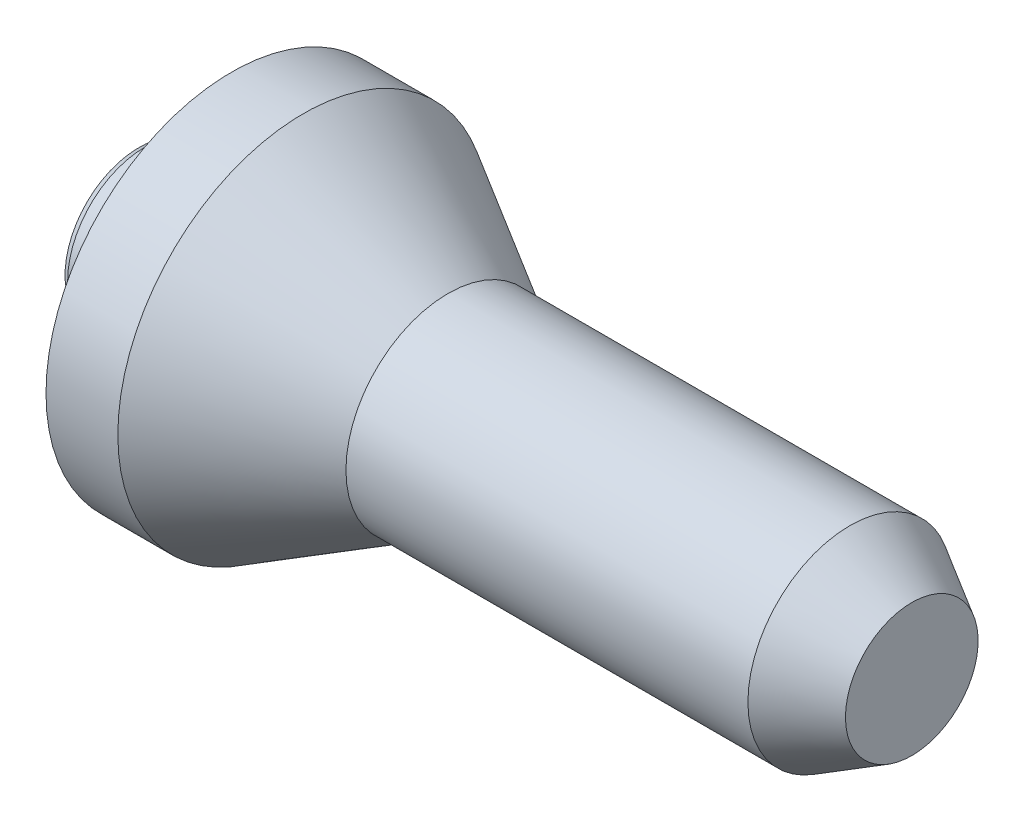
ISO-10303-21;
HEADER;
FILE_DESCRIPTION(('STEP AP214'),'2;1');
FILE_NAME('part.step','',(''),(''),'','','');
FILE_SCHEMA(('AUTOMOTIVE_DESIGN { 1 0 10303 214 1 1 1 1 }'));
ENDSEC;
DATA;
#1=APPLICATION_CONTEXT('core data for automotive mechanical design processes');
#2=APPLICATION_PROTOCOL_DEFINITION('international standard','automotive_design',2000,#1);
#3=PRODUCT_CONTEXT('',#1,'mechanical');
#4=PRODUCT('Part','Part','',(#3));
#5=PRODUCT_RELATED_PRODUCT_CATEGORY('part','',(#4));
#6=PRODUCT_DEFINITION_FORMATION('','',#4);
#7=PRODUCT_DEFINITION_CONTEXT('part definition',#1,'design');
#8=PRODUCT_DEFINITION('design','',#6,#7);
#9=PRODUCT_DEFINITION_SHAPE('','',#8);
#10=(LENGTH_UNIT() NAMED_UNIT(*) SI_UNIT(.MILLI.,.METRE.));
#11=(NAMED_UNIT(*) PLANE_ANGLE_UNIT() SI_UNIT($,.RADIAN.));
#12=(NAMED_UNIT(*) SI_UNIT($,.STERADIAN.) SOLID_ANGLE_UNIT());
#13=UNCERTAINTY_MEASURE_WITH_UNIT(LENGTH_MEASURE(1.E-05),#10,'distance_accuracy_value','');
#14=(GEOMETRIC_REPRESENTATION_CONTEXT(3) GLOBAL_UNCERTAINTY_ASSIGNED_CONTEXT((#13)) GLOBAL_UNIT_ASSIGNED_CONTEXT((#10,
#11,#12)) REPRESENTATION_CONTEXT('',''));
#15=CARTESIAN_POINT('',(0.,0.,0.));
#16=DIRECTION('',(0.,0.,1.));
#17=DIRECTION('',(1.,0.,0.));
#18=AXIS2_PLACEMENT_3D('',#15,#16,#17);
#19=CARTESIAN_POINT('',(0.,0.,0.));
#20=DIRECTION('',(1.,0.,0.));
#21=DIRECTION('',(0.,0.,-1.));
#22=AXIS2_PLACEMENT_3D('',#19,#20,#21);
#23=PLANE('',#22);
#24=CARTESIAN_POINT('',(0.,0.,0.));
#25=DIRECTION('',(1.,0.,0.));
#26=DIRECTION('',(0.,0.,-1.));
#27=AXIS2_PLACEMENT_3D('',#24,#25,#26);
#28=CIRCLE('',#27,11.9226497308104);
#29=CARTESIAN_POINT('',(0.,0.,-11.9226497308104));
#30=VERTEX_POINT('',#29);
#31=EDGE_CURVE('E40',#30,#30,#28,.F.);
#32=ORIENTED_EDGE('',*,*,#31,.T.);
#33=EDGE_LOOP('',(#32));
#34=FACE_BOUND('',#33,.T.);
#35=CARTESIAN_POINT('',(0.,0.,0.));
#36=DIRECTION('',(-1.,0.,0.));
#37=DIRECTION('',(0.,0.,1.));
#38=AXIS2_PLACEMENT_3D('',#35,#36,#37);
#39=CIRCLE('',#38,8.25);
#40=CARTESIAN_POINT('',(0.,0.,8.25));
#41=VERTEX_POINT('',#40);
#42=EDGE_CURVE('E60',#41,#41,#39,.T.);
#43=ORIENTED_EDGE('',*,*,#42,.F.);
#44=EDGE_LOOP('',(#43));
#45=FACE_BOUND('',#44,.T.);
#46=ADVANCED_FACE('F33',(#34,#45),#23,.F.);
#47=CARTESIAN_POINT('',(-16.4655274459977,0.,0.));
#48=DIRECTION('',(-1.,0.,0.));
#49=DIRECTION('',(0.,0.,1.));
#50=AXIS2_PLACEMENT_3D('',#47,#48,#49);
#51=CYLINDRICAL_SURFACE('',#50,12.5);
#52=CARTESIAN_POINT('',(1.00000000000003,0.,0.));
#53=DIRECTION('',(1.,0.,0.));
#54=DIRECTION('',(0.,0.,-1.));
#55=AXIS2_PLACEMENT_3D('',#52,#53,#54);
#56=CIRCLE('',#55,12.5);
#57=CARTESIAN_POINT('',(1.00000000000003,0.,-12.5));
#58=VERTEX_POINT('',#57);
#59=EDGE_CURVE('E11',#58,#58,#56,.T.);
#60=ORIENTED_EDGE('',*,*,#59,.T.);
#61=EDGE_LOOP('',(#60));
#62=FACE_BOUND('',#61,.T.);
#63=CARTESIAN_POINT('',(15.,0.,0.));
#64=DIRECTION('',(-1.,0.,0.));
#65=DIRECTION('',(0.,0.,1.));
#66=AXIS2_PLACEMENT_3D('',#63,#64,#65);
#67=CIRCLE('',#66,12.5);
#68=CARTESIAN_POINT('',(15.,0.,12.5));
#69=VERTEX_POINT('',#68);
#70=EDGE_CURVE('E75',#69,#69,#67,.T.);
#71=ORIENTED_EDGE('',*,*,#70,.T.);
#72=EDGE_LOOP('',(#71));
#73=FACE_BOUND('',#72,.T.);
#74=ADVANCED_FACE('F92',(#62,#73),#51,.T.);
#75=CARTESIAN_POINT('',(15.,12.5,0.));
#76=DIRECTION('',(1.,0.,0.));
#77=DIRECTION('',(0.,0.,-1.));
#78=AXIS2_PLACEMENT_3D('',#75,#76,#77);
#79=PLANE('',#78);
#80=ORIENTED_EDGE('',*,*,#70,.F.);
#81=EDGE_LOOP('',(#80));
#82=FACE_BOUND('',#81,.T.);
#83=CARTESIAN_POINT('',(15.,0.,0.));
#84=DIRECTION('',(-1.,0.,0.));
#85=DIRECTION('',(0.,0.,1.));
#86=AXIS2_PLACEMENT_3D('',#83,#84,#85);
#87=CIRCLE('',#86,30.);
#88=CARTESIAN_POINT('',(15.,0.,30.));
#89=VERTEX_POINT('',#88);
#90=EDGE_CURVE('E72',#89,#89,#87,.T.);
#91=ORIENTED_EDGE('',*,*,#90,.T.);
#92=EDGE_LOOP('',(#91));
#93=FACE_BOUND('',#92,.T.);
#94=ADVANCED_FACE('F96',(#82,#93),#79,.F.);
#95=CARTESIAN_POINT('',(-16.4655274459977,0.,0.));
#96=DIRECTION('',(-1.,0.,0.));
#97=DIRECTION('',(0.,0.,1.));
#98=AXIS2_PLACEMENT_3D('',#95,#96,#97);
#99=CYLINDRICAL_SURFACE('',#98,30.);
#100=ORIENTED_EDGE('',*,*,#90,.F.);
#101=EDGE_LOOP('',(#100));
#102=FACE_BOUND('',#101,.T.);
#103=CARTESIAN_POINT('',(26.6173140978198,0.,0.));
#104=DIRECTION('',(-1.,0.,0.));
#105=DIRECTION('',(0.,0.,1.));
#106=AXIS2_PLACEMENT_3D('',#103,#104,#105);
#107=CIRCLE('',#106,30.);
#108=CARTESIAN_POINT('',(26.6173140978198,0.,30.));
#109=VERTEX_POINT('',#108);
#110=EDGE_CURVE('E69',#109,#109,#107,.T.);
#111=ORIENTED_EDGE('',*,*,#110,.T.);
#112=EDGE_LOOP('',(#111));
#113=FACE_BOUND('',#112,.T.);
#114=ADVANCED_FACE('F102',(#102,#113),#99,.T.);
#115=CARTESIAN_POINT('',(50.,0.,0.));
#116=DIRECTION('',(-1.,0.,0.));
#117=DIRECTION('',(0.,0.,1.));
#118=AXIS2_PLACEMENT_3D('',#115,#116,#117);
#119=CONICAL_SURFACE('',#118,16.5,0.523598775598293);
#120=ORIENTED_EDGE('',*,*,#110,.F.);
#121=EDGE_LOOP('',(#120));
#122=FACE_BOUND('',#121,.T.);
#123=CARTESIAN_POINT('',(50.,0.,0.));
#124=DIRECTION('',(-1.,0.,0.));
#125=DIRECTION('',(0.,0.,1.));
#126=AXIS2_PLACEMENT_3D('',#123,#124,#125);
#127=CIRCLE('',#126,16.5);
#128=CARTESIAN_POINT('',(50.,0.,16.5));
#129=VERTEX_POINT('',#128);
#130=EDGE_CURVE('E66',#129,#129,#127,.T.);
#131=ORIENTED_EDGE('',*,*,#130,.T.);
#132=EDGE_LOOP('',(#131));
#133=FACE_BOUND('',#132,.T.);
#134=ADVANCED_FACE('F106',(#122,#133),#119,.T.);
#135=CARTESIAN_POINT('',(-16.4655274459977,0.,0.));
#136=DIRECTION('',(-1.,0.,0.));
#137=DIRECTION('',(0.,0.,1.));
#138=AXIS2_PLACEMENT_3D('',#135,#136,#137);
#139=CYLINDRICAL_SURFACE('',#138,16.5);
#140=ORIENTED_EDGE('',*,*,#130,.F.);
#141=EDGE_LOOP('',(#140));
#142=FACE_BOUND('',#141,.T.);
#143=CARTESIAN_POINT('',(115.,0.,0.));
#144=DIRECTION('',(-1.,0.,0.));
#145=DIRECTION('',(0.,0.,1.));
#146=AXIS2_PLACEMENT_3D('',#143,#144,#145);
#147=CIRCLE('',#146,16.5);
#148=CARTESIAN_POINT('',(115.,0.,16.5));
#149=VERTEX_POINT('',#148);
#150=EDGE_CURVE('E57',#149,#149,#147,.T.);
#151=ORIENTED_EDGE('',*,*,#150,.T.);
#152=EDGE_LOOP('',(#151));
#153=FACE_BOUND('',#152,.T.);
#154=ADVANCED_FACE('F110',(#142,#153),#139,.T.);
#155=CARTESIAN_POINT('',(125.,0.,0.));
#156=DIRECTION('',(-1.,0.,0.));
#157=DIRECTION('',(0.,0.,1.));
#158=AXIS2_PLACEMENT_3D('',#155,#156,#157);
#159=CONICAL_SURFACE('',#158,10.7264973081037,0.5235987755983);
#160=ORIENTED_EDGE('',*,*,#150,.F.);
#161=EDGE_LOOP('',(#160));
#162=FACE_BOUND('',#161,.T.);
#163=CARTESIAN_POINT('',(125.,0.,0.));
#164=DIRECTION('',(-1.,0.,0.));
#165=DIRECTION('',(0.,0.,1.));
#166=AXIS2_PLACEMENT_3D('',#163,#164,#165);
#167=CIRCLE('',#166,10.7264973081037);
#168=CARTESIAN_POINT('',(125.,0.,10.7264973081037));
#169=VERTEX_POINT('',#168);
#170=EDGE_CURVE('E53',#169,#169,#167,.T.);
#171=ORIENTED_EDGE('',*,*,#170,.T.);
#172=EDGE_LOOP('',(#171));
#173=FACE_BOUND('',#172,.T.);
#174=ADVANCED_FACE('F114',(#162,#173),#159,.T.);
#175=CARTESIAN_POINT('',(125.,10.7264973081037,0.));
#176=DIRECTION('',(-1.,0.,0.));
#177=DIRECTION('',(0.,0.,1.));
#178=AXIS2_PLACEMENT_3D('',#175,#176,#177);
#179=PLANE('',#178);
#180=ORIENTED_EDGE('',*,*,#170,.F.);
#181=EDGE_LOOP('',(#180));
#182=FACE_BOUND('',#181,.T.);
#183=ADVANCED_FACE('F47',(#182),#179,.F.);
#184=CARTESIAN_POINT('',(45.,0.,0.));
#185=DIRECTION('',(-1.,0.,0.));
#186=DIRECTION('',(0.,0.,1.));
#187=AXIS2_PLACEMENT_3D('',#184,#185,#186);
#188=CONICAL_SURFACE('',#187,6.99999999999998,1.02974425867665);
#189=CARTESIAN_POINT('',(49.2060243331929,0.,0.));
#190=VERTEX_POINT('',#189);
#191=VERTEX_LOOP('',#190);
#192=FACE_BOUND('',#191,.T.);
#193=CARTESIAN_POINT('',(45.,0.,0.));
#194=DIRECTION('',(-1.,0.,0.));
#195=DIRECTION('',(0.,0.,1.));
#196=AXIS2_PLACEMENT_3D('',#193,#194,#195);
#197=CIRCLE('',#196,6.99999999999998);
#198=CARTESIAN_POINT('',(45.,0.,6.99999999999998));
#199=VERTEX_POINT('',#198);
#200=EDGE_CURVE('E51',#199,#199,#197,.T.);
#201=ORIENTED_EDGE('',*,*,#200,.T.);
#202=EDGE_LOOP('',(#201));
#203=FACE_BOUND('',#202,.T.);
#204=ADVANCED_FACE('F43',(#192,#203),#188,.F.);
#205=CARTESIAN_POINT('',(0.,0.,0.));
#206=DIRECTION('',(-1.,0.,0.));
#207=DIRECTION('',(0.,0.,1.));
#208=AXIS2_PLACEMENT_3D('',#205,#206,#207);
#209=CYLINDRICAL_SURFACE('',#208,6.99999999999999);
#210=ORIENTED_EDGE('',*,*,#200,.F.);
#211=EDGE_LOOP('',(#210));
#212=FACE_BOUND('',#211,.T.);
#213=CARTESIAN_POINT('',(1.25,0.,0.));
#214=DIRECTION('',(-1.,0.,0.));
#215=DIRECTION('',(0.,0.,1.));
#216=AXIS2_PLACEMENT_3D('',#213,#214,#215);
#217=CIRCLE('',#216,6.99999999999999);
#218=CARTESIAN_POINT('',(1.25,0.,6.99999999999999));
#219=VERTEX_POINT('',#218);
#220=EDGE_CURVE('E54',#219,#219,#217,.T.);
#221=ORIENTED_EDGE('',*,*,#220,.T.);
#222=EDGE_LOOP('',(#221));
#223=FACE_BOUND('',#222,.T.);
#224=ADVANCED_FACE('F46',(#212,#223),#209,.F.);
#225=CARTESIAN_POINT('',(0.,0.,0.));
#226=DIRECTION('',(-1.,0.,0.));
#227=DIRECTION('',(0.,0.,1.));
#228=AXIS2_PLACEMENT_3D('',#225,#226,#227);
#229=CONICAL_SURFACE('',#228,8.25,0.78539816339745);
#230=ORIENTED_EDGE('',*,*,#220,.F.);
#231=EDGE_LOOP('',(#230));
#232=FACE_BOUND('',#231,.T.);
#233=ORIENTED_EDGE('',*,*,#42,.T.);
#234=EDGE_LOOP('',(#233));
#235=FACE_BOUND('',#234,.T.);
#236=ADVANCED_FACE('F83',(#232,#235),#229,.F.);
#237=CARTESIAN_POINT('',(0.,0.,0.));
#238=DIRECTION('',(1.,0.,0.));
#239=DIRECTION('',(0.,0.,-1.));
#240=AXIS2_PLACEMENT_3D('',#237,#238,#239);
#241=CONICAL_SURFACE('',#240,11.9226497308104,0.523598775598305);
#242=ORIENTED_EDGE('',*,*,#59,.F.);
#243=EDGE_LOOP('',(#242));
#244=FACE_BOUND('',#243,.T.);
#245=ORIENTED_EDGE('',*,*,#31,.F.);
#246=EDGE_LOOP('',(#245));
#247=FACE_BOUND('',#246,.T.);
#248=ADVANCED_FACE('F35',(#244,#247),#241,.T.);
#249=CLOSED_SHELL('',(#46,#74,#94,#114,#134,#154,#174,#183,#204,#224,#236,#248));
#250=MANIFOLD_SOLID_BREP('B2',#249);
#251=ADVANCED_BREP_SHAPE_REPRESENTATION('',(#18,#250),#14);
#252=SHAPE_DEFINITION_REPRESENTATION(#9,#251);
ENDSEC;
END-ISO-10303-21;
